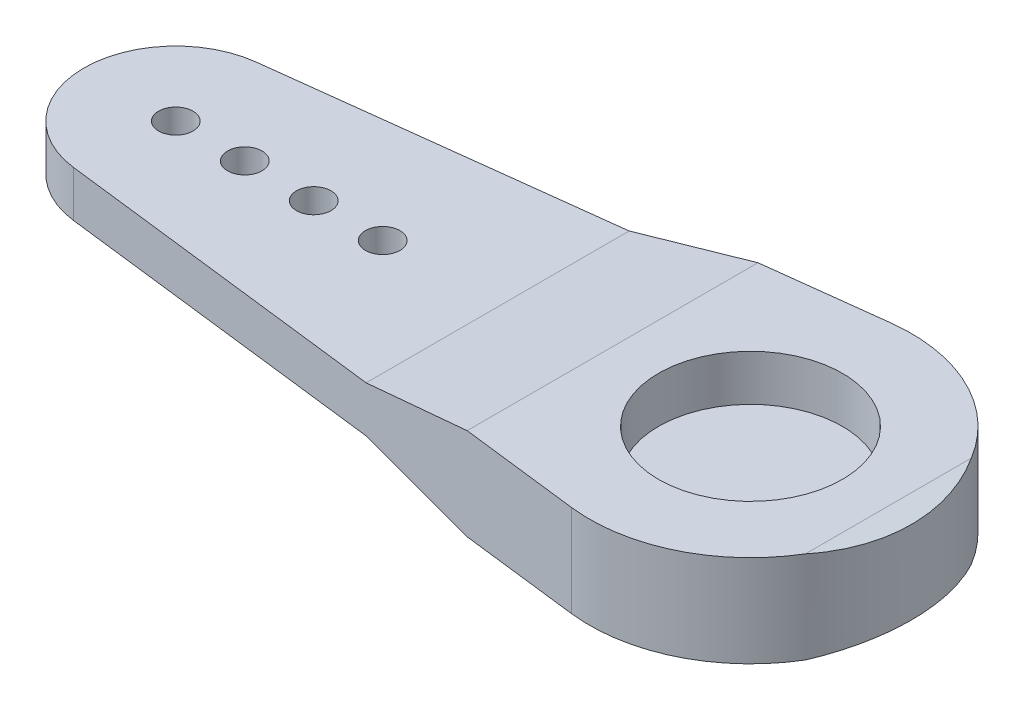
ISO-10303-21;
HEADER;
FILE_DESCRIPTION(('STEP AP214'),'2;1');
FILE_NAME('part.step','',(''),(''),'','','');
FILE_SCHEMA(('AUTOMOTIVE_DESIGN { 1 0 10303 214 1 1 1 1 }'));
ENDSEC;
DATA;
#1=APPLICATION_CONTEXT('core data for automotive mechanical design processes');
#2=APPLICATION_PROTOCOL_DEFINITION('international standard','automotive_design',2000,#1);
#3=PRODUCT_CONTEXT('',#1,'mechanical');
#4=PRODUCT('Part','Part','',(#3));
#5=PRODUCT_RELATED_PRODUCT_CATEGORY('part','',(#4));
#6=PRODUCT_DEFINITION_FORMATION('','',#4);
#7=PRODUCT_DEFINITION_CONTEXT('part definition',#1,'design');
#8=PRODUCT_DEFINITION('design','',#6,#7);
#9=PRODUCT_DEFINITION_SHAPE('','',#8);
#10=(LENGTH_UNIT() NAMED_UNIT(*) SI_UNIT(.MILLI.,.METRE.));
#11=(NAMED_UNIT(*) PLANE_ANGLE_UNIT() SI_UNIT($,.RADIAN.));
#12=(NAMED_UNIT(*) SI_UNIT($,.STERADIAN.) SOLID_ANGLE_UNIT());
#13=UNCERTAINTY_MEASURE_WITH_UNIT(LENGTH_MEASURE(1.E-05),#10,'distance_accuracy_value','');
#14=(GEOMETRIC_REPRESENTATION_CONTEXT(3) GLOBAL_UNCERTAINTY_ASSIGNED_CONTEXT((#13)) GLOBAL_UNIT_ASSIGNED_CONTEXT((#10,
#11,#12)) REPRESENTATION_CONTEXT('',''));
#15=CARTESIAN_POINT('',(0.,0.,0.));
#16=DIRECTION('',(0.,0.,1.));
#17=DIRECTION('',(1.,0.,0.));
#18=AXIS2_PLACEMENT_3D('',#15,#16,#17);
#19=CARTESIAN_POINT('',(-6.,0.,30.));
#20=DIRECTION('',(0.,1.,0.));
#21=DIRECTION('',(0.,0.,1.));
#22=AXIS2_PLACEMENT_3D('',#19,#20,#21);
#23=PLANE('',#22);
#24=DIRECTION('',(-0.992773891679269,0.,0.12));
#25=VECTOR('',#24,1.);
#26=CARTESIAN_POINT('',(-25.48,0.,11.0289044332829));
#27=LINE('',#26,#25);
#28=CARTESIAN_POINT('',(-0.839999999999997,0.,8.05058275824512));
#29=VERTEX_POINT('',#28);
#30=CARTESIAN_POINT('',(-5.99999999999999,0.,8.67428973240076));
#31=VERTEX_POINT('',#30);
#32=EDGE_CURVE('E125',#29,#31,#27,.T.);
#33=ORIENTED_EDGE('',*,*,#32,.F.);
#34=CARTESIAN_POINT('',(0.,0.,15.));
#35=DIRECTION('',(0.,1.,0.));
#36=DIRECTION('',(0.,0.,1.));
#37=AXIS2_PLACEMENT_3D('',#34,#35,#36);
#38=CIRCLE('',#37,7.);
#39=CARTESIAN_POINT('',(6.,0.,11.394448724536));
#40=VERTEX_POINT('',#39);
#41=EDGE_CURVE('E111',#40,#29,#38,.T.);
#42=ORIENTED_EDGE('',*,*,#41,.F.);
#43=DIRECTION('',(0.,0.,-1.));
#44=VECTOR('',#43,1.);
#45=CARTESIAN_POINT('',(6.,0.,30.));
#46=LINE('',#45,#44);
#47=CARTESIAN_POINT('',(6.,0.,18.605551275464));
#48=VERTEX_POINT('',#47);
#49=EDGE_CURVE('E181',#48,#40,#46,.T.);
#50=ORIENTED_EDGE('',*,*,#49,.F.);
#51=CARTESIAN_POINT('',(-0.840000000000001,0.,21.9494172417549));
#52=VERTEX_POINT('',#51);
#53=EDGE_CURVE('E51',#52,#48,#38,.T.);
#54=ORIENTED_EDGE('',*,*,#53,.F.);
#55=DIRECTION('',(0.992773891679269,0.,0.12));
#56=VECTOR('',#55,1.);
#57=CARTESIAN_POINT('',(-0.839999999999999,0.,21.9494172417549));
#58=LINE('',#57,#56);
#59=CARTESIAN_POINT('',(-6.,0.,21.3257102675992));
#60=VERTEX_POINT('',#59);
#61=EDGE_CURVE('E121',#60,#52,#58,.T.);
#62=ORIENTED_EDGE('',*,*,#61,.F.);
#63=DIRECTION('',(0.,0.,-1.));
#64=VECTOR('',#63,1.);
#65=CARTESIAN_POINT('',(-6.,0.,30.));
#66=LINE('',#65,#64);
#67=EDGE_CURVE('E137',#60,#31,#66,.T.);
#68=ORIENTED_EDGE('',*,*,#67,.T.);
#69=EDGE_LOOP('',(#33,#42,#50,#54,#62,#68));
#70=FACE_BOUND('',#69,.T.);
#71=CARTESIAN_POINT('',(0.,0.,15.));
#72=DIRECTION('',(0.,1.,0.));
#73=DIRECTION('',(0.,0.,1.));
#74=AXIS2_PLACEMENT_3D('',#71,#72,#73);
#75=CIRCLE('',#74,5.);
#76=CARTESIAN_POINT('',(0.,0.,20.));
#77=VERTEX_POINT('',#76);
#78=EDGE_CURVE('E11',#77,#77,#75,.F.);
#79=ORIENTED_EDGE('',*,*,#78,.F.);
#80=EDGE_LOOP('',(#79));
#81=FACE_BOUND('',#80,.T.);
#82=ADVANCED_FACE('F34',(#70,#81),#23,.F.);
#83=CARTESIAN_POINT('',(-6.,4.,30.));
#84=DIRECTION('',(0.,-1.,0.));
#85=DIRECTION('',(0.,0.,-1.));
#86=AXIS2_PLACEMENT_3D('',#83,#84,#85);
#87=PLANE('',#86);
#88=CARTESIAN_POINT('',(0.,4.,15.));
#89=DIRECTION('',(0.,1.,0.));
#90=DIRECTION('',(0.,0.,1.));
#91=AXIS2_PLACEMENT_3D('',#88,#89,#90);
#92=CIRCLE('',#91,4.);
#93=CARTESIAN_POINT('',(0.,4.,19.));
#94=VERTEX_POINT('',#93);
#95=EDGE_CURVE('E222',#94,#94,#92,.T.);
#96=ORIENTED_EDGE('',*,*,#95,.F.);
#97=EDGE_LOOP('',(#96));
#98=FACE_BOUND('',#97,.T.);
#99=DIRECTION('',(-0.992773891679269,0.,0.12));
#100=VECTOR('',#99,1.);
#101=CARTESIAN_POINT('',(-25.48,4.,11.0289044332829));
#102=LINE('',#101,#100);
#103=CARTESIAN_POINT('',(-0.839999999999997,4.,8.05058275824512));
#104=VERTEX_POINT('',#103);
#105=CARTESIAN_POINT('',(-5.99999999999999,4.,8.67428973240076));
#106=VERTEX_POINT('',#105);
#107=EDGE_CURVE('E128',#104,#106,#102,.T.);
#108=ORIENTED_EDGE('',*,*,#107,.T.);
#109=DIRECTION('',(0.,0.,-1.));
#110=VECTOR('',#109,1.);
#111=CARTESIAN_POINT('',(-6.,4.,30.));
#112=LINE('',#111,#110);
#113=CARTESIAN_POINT('',(-6.,4.,21.3257102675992));
#114=VERTEX_POINT('',#113);
#115=EDGE_CURVE('E175',#114,#106,#112,.T.);
#116=ORIENTED_EDGE('',*,*,#115,.F.);
#117=DIRECTION('',(0.992773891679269,0.,0.12));
#118=VECTOR('',#117,1.);
#119=CARTESIAN_POINT('',(-0.839999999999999,4.,21.9494172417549));
#120=LINE('',#119,#118);
#121=CARTESIAN_POINT('',(-0.839999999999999,4.,21.9494172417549));
#122=VERTEX_POINT('',#121);
#123=EDGE_CURVE('E144',#114,#122,#120,.T.);
#124=ORIENTED_EDGE('',*,*,#123,.T.);
#125=CARTESIAN_POINT('',(0.,4.,15.));
#126=DIRECTION('',(0.,1.,0.));
#127=DIRECTION('',(0.,0.,1.));
#128=AXIS2_PLACEMENT_3D('',#125,#126,#127);
#129=CIRCLE('',#128,7.);
#130=CARTESIAN_POINT('',(6.,4.,18.605551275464));
#131=VERTEX_POINT('',#130);
#132=EDGE_CURVE('E57',#122,#131,#129,.T.);
#133=ORIENTED_EDGE('',*,*,#132,.T.);
#134=DIRECTION('',(0.,0.,-1.));
#135=VECTOR('',#134,1.);
#136=CARTESIAN_POINT('',(6.,4.,30.));
#137=LINE('',#136,#135);
#138=CARTESIAN_POINT('',(6.,4.,11.394448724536));
#139=VERTEX_POINT('',#138);
#140=EDGE_CURVE('E178',#131,#139,#137,.T.);
#141=ORIENTED_EDGE('',*,*,#140,.T.);
#142=EDGE_CURVE('E147',#139,#104,#129,.T.);
#143=ORIENTED_EDGE('',*,*,#142,.T.);
#144=EDGE_LOOP('',(#108,#116,#124,#133,#141,#143));
#145=FACE_BOUND('',#144,.T.);
#146=ADVANCED_FACE('F248',(#98,#145),#87,.F.);
#147=CARTESIAN_POINT('',(6.,4.,30.));
#148=DIRECTION('',(-0.196116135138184,-0.98058067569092,0.));
#149=DIRECTION('',(0.98058067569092,-0.196116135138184,0.));
#150=AXIS2_PLACEMENT_3D('',#147,#148,#149);
#151=PLANE('',#150);
#152=CARTESIAN_POINT('',(0.,5.2,15.));
#153=DIRECTION('',(-0.196116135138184,-0.98058067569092,0.));
#154=DIRECTION('',(-0.98058067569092,0.196116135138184,0.));
#155=AXIS2_PLACEMENT_3D('',#152,#153,#154);
#156=ELLIPSE('',#155,7.1386273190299,7.);
#157=EDGE_CURVE('E162',#139,#131,#156,.T.);
#158=ORIENTED_EDGE('',*,*,#157,.F.);
#159=ORIENTED_EDGE('',*,*,#140,.F.);
#160=EDGE_LOOP('',(#158,#159));
#161=FACE_BOUND('',#160,.T.);
#162=ADVANCED_FACE('F252',(#161),#151,.F.);
#163=CARTESIAN_POINT('',(-30.,3.,30.));
#164=DIRECTION('',(0.,-1.,0.));
#165=DIRECTION('',(0.,0.,-1.));
#166=AXIS2_PLACEMENT_3D('',#163,#164,#165);
#167=PLANE('',#166);
#168=CARTESIAN_POINT('',(-25.,3.,15.));
#169=DIRECTION('',(0.,1.,0.));
#170=DIRECTION('',(0.,0.,1.));
#171=AXIS2_PLACEMENT_3D('',#168,#169,#170);
#172=CIRCLE('',#171,0.750000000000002);
#173=CARTESIAN_POINT('',(-25.,3.,15.75));
#174=VERTEX_POINT('',#173);
#175=EDGE_CURVE('E211',#174,#174,#172,.T.);
#176=ORIENTED_EDGE('',*,*,#175,.F.);
#177=EDGE_LOOP('',(#176));
#178=FACE_BOUND('',#177,.T.);
#179=CARTESIAN_POINT('',(-22.,3.,15.));
#180=DIRECTION('',(0.,1.,0.));
#181=DIRECTION('',(0.,0.,1.));
#182=AXIS2_PLACEMENT_3D('',#179,#180,#181);
#183=CIRCLE('',#182,0.750000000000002);
#184=CARTESIAN_POINT('',(-22.,3.,15.75));
#185=VERTEX_POINT('',#184);
#186=EDGE_CURVE('E201',#185,#185,#183,.T.);
#187=ORIENTED_EDGE('',*,*,#186,.F.);
#188=EDGE_LOOP('',(#187));
#189=FACE_BOUND('',#188,.T.);
#190=CARTESIAN_POINT('',(-19.,3.,15.));
#191=DIRECTION('',(0.,1.,0.));
#192=DIRECTION('',(0.,0.,1.));
#193=AXIS2_PLACEMENT_3D('',#190,#191,#192);
#194=CIRCLE('',#193,0.750000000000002);
#195=CARTESIAN_POINT('',(-19.,3.,15.75));
#196=VERTEX_POINT('',#195);
#197=EDGE_CURVE('E198',#196,#196,#194,.T.);
#198=ORIENTED_EDGE('',*,*,#197,.F.);
#199=EDGE_LOOP('',(#198));
#200=FACE_BOUND('',#199,.T.);
#201=CARTESIAN_POINT('',(-16.,3.,15.));
#202=DIRECTION('',(0.,1.,0.));
#203=DIRECTION('',(0.,0.,1.));
#204=AXIS2_PLACEMENT_3D('',#201,#202,#203);
#205=CIRCLE('',#204,0.75);
#206=CARTESIAN_POINT('',(-16.,3.,15.75));
#207=VERTEX_POINT('',#206);
#208=EDGE_CURVE('E195',#207,#207,#205,.T.);
#209=ORIENTED_EDGE('',*,*,#208,.F.);
#210=EDGE_LOOP('',(#209));
#211=FACE_BOUND('',#210,.T.);
#212=DIRECTION('',(0.992773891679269,0.,-0.12));
#213=VECTOR('',#212,1.);
#214=CARTESIAN_POINT('',(-32.1949930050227,3.,11.8405687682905));
#215=LINE('',#214,#213);
#216=CARTESIAN_POINT('',(-25.48,3.,11.0289044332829));
#217=VERTEX_POINT('',#216);
#218=CARTESIAN_POINT('',(-11.,3.,9.27865695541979));
#219=VERTEX_POINT('',#218);
#220=EDGE_CURVE('E169',#217,#219,#215,.T.);
#221=ORIENTED_EDGE('',*,*,#220,.F.);
#222=CARTESIAN_POINT('',(-25.,3.,15.));
#223=DIRECTION('',(0.,-1.,0.));
#224=DIRECTION('',(0.,0.,-1.));
#225=AXIS2_PLACEMENT_3D('',#222,#223,#224);
#226=CIRCLE('',#225,4.);
#227=CARTESIAN_POINT('',(-25.48,3.,18.9710955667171));
#228=VERTEX_POINT('',#227);
#229=EDGE_CURVE('E173',#228,#217,#226,.T.);
#230=ORIENTED_EDGE('',*,*,#229,.F.);
#231=DIRECTION('',(-0.992773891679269,0.,-0.12));
#232=VECTOR('',#231,1.);
#233=CARTESIAN_POINT('',(-28.6210069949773,3.,18.5914312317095));
#234=LINE('',#233,#232);
#235=CARTESIAN_POINT('',(-11.,3.,20.7213430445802));
#236=VERTEX_POINT('',#235);
#237=EDGE_CURVE('E158',#236,#228,#234,.T.);
#238=ORIENTED_EDGE('',*,*,#237,.F.);
#239=DIRECTION('',(0.,0.,-1.));
#240=VECTOR('',#239,1.);
#241=CARTESIAN_POINT('',(-11.,3.,30.));
#242=LINE('',#241,#240);
#243=EDGE_CURVE('E187',#236,#219,#242,.T.);
#244=ORIENTED_EDGE('',*,*,#243,.T.);
#245=EDGE_LOOP('',(#221,#230,#238,#244));
#246=FACE_BOUND('',#245,.T.);
#247=ADVANCED_FACE('F258',(#178,#189,#200,#211,#246),#167,.F.);
#248=CARTESIAN_POINT('',(-11.,3.,30.));
#249=DIRECTION('',(0.196116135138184,-0.98058067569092,0.));
#250=DIRECTION('',(0.98058067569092,0.196116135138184,0.));
#251=AXIS2_PLACEMENT_3D('',#248,#249,#250);
#252=PLANE('',#251);
#253=DIRECTION('',(0.973764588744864,0.194752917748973,-0.117702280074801));
#254=VECTOR('',#253,1.);
#255=CARTESIAN_POINT('',(-13.3749624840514,2.52500750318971,9.56572685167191));
#256=LINE('',#255,#254);
#257=EDGE_CURVE('E171',#219,#106,#256,.T.);
#258=ORIENTED_EDGE('',*,*,#257,.F.);
#259=ORIENTED_EDGE('',*,*,#243,.F.);
#260=DIRECTION('',(-0.973764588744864,-0.194752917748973,-0.117702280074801));
#261=VECTOR('',#260,1.);
#262=CARTESIAN_POINT('',(-9.93653311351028,3.21269337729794,20.8498879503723));
#263=LINE('',#262,#261);
#264=EDGE_CURVE('E160',#114,#236,#263,.T.);
#265=ORIENTED_EDGE('',*,*,#264,.F.);
#266=ORIENTED_EDGE('',*,*,#115,.T.);
#267=EDGE_LOOP('',(#258,#259,#265,#266));
#268=FACE_BOUND('',#267,.T.);
#269=ADVANCED_FACE('F36',(#268),#252,.F.);
#270=CARTESIAN_POINT('',(-25.,0.,15.));
#271=DIRECTION('',(0.,1.,0.));
#272=DIRECTION('',(0.,0.,1.));
#273=AXIS2_PLACEMENT_3D('',#270,#271,#272);
#274=CYLINDRICAL_SURFACE('',#273,4.);
#275=ORIENTED_EDGE('',*,*,#229,.T.);
#276=DIRECTION('',(0.,1.,0.));
#277=VECTOR('',#276,1.);
#278=CARTESIAN_POINT('',(-25.48,0.,11.0289044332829));
#279=LINE('',#278,#277);
#280=CARTESIAN_POINT('',(-25.48,1.,11.0289044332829));
#281=VERTEX_POINT('',#280);
#282=EDGE_CURVE('E130',#281,#217,#279,.T.);
#283=ORIENTED_EDGE('',*,*,#282,.F.);
#284=CARTESIAN_POINT('',(-25.,1.,15.));
#285=DIRECTION('',(0.,1.,0.));
#286=DIRECTION('',(0.,0.,1.));
#287=AXIS2_PLACEMENT_3D('',#284,#285,#286);
#288=CIRCLE('',#287,4.);
#289=CARTESIAN_POINT('',(-25.48,1.,18.9710955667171));
#290=VERTEX_POINT('',#289);
#291=EDGE_CURVE('E43',#281,#290,#288,.T.);
#292=ORIENTED_EDGE('',*,*,#291,.T.);
#293=DIRECTION('',(0.,1.,0.));
#294=VECTOR('',#293,1.);
#295=CARTESIAN_POINT('',(-25.48,0.,18.9710955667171));
#296=LINE('',#295,#294);
#297=EDGE_CURVE('E138',#290,#228,#296,.T.);
#298=ORIENTED_EDGE('',*,*,#297,.T.);
#299=EDGE_LOOP('',(#275,#283,#292,#298));
#300=FACE_BOUND('',#299,.T.);
#301=ADVANCED_FACE('F265',(#300),#274,.T.);
#302=CARTESIAN_POINT('',(-25.48,0.,11.0289044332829));
#303=DIRECTION('',(-0.12,0.,-0.992773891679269));
#304=DIRECTION('',(-0.992773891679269,0.,0.12));
#305=AXIS2_PLACEMENT_3D('',#302,#303,#304);
#306=PLANE('',#305);
#307=ORIENTED_EDGE('',*,*,#257,.T.);
#308=ORIENTED_EDGE('',*,*,#107,.F.);
#309=DIRECTION('',(0.,1.,0.));
#310=VECTOR('',#309,1.);
#311=CARTESIAN_POINT('',(-0.839999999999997,0.,8.05058275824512));
#312=LINE('',#311,#310);
#313=EDGE_CURVE('E114',#29,#104,#312,.T.);
#314=ORIENTED_EDGE('',*,*,#313,.F.);
#315=ORIENTED_EDGE('',*,*,#32,.T.);
#316=DIRECTION('',(-0.973764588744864,0.194752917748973,0.117702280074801));
#317=VECTOR('',#316,1.);
#318=CARTESIAN_POINT('',(-8.44423161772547,0.488846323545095,8.96973242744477));
#319=LINE('',#318,#317);
#320=CARTESIAN_POINT('',(-11.,1.,9.27865695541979));
#321=VERTEX_POINT('',#320);
#322=EDGE_CURVE('E165',#31,#321,#319,.T.);
#323=ORIENTED_EDGE('',*,*,#322,.T.);
#324=DIRECTION('',(-0.992773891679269,0.,0.12));
#325=VECTOR('',#324,1.);
#326=CARTESIAN_POINT('',(-32.1949930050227,1.,11.8405687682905));
#327=LINE('',#326,#325);
#328=EDGE_CURVE('E167',#321,#281,#327,.T.);
#329=ORIENTED_EDGE('',*,*,#328,.T.);
#330=ORIENTED_EDGE('',*,*,#282,.T.);
#331=ORIENTED_EDGE('',*,*,#220,.T.);
#332=EDGE_LOOP('',(#307,#308,#314,#315,#323,#329,#330,#331));
#333=FACE_BOUND('',#332,.T.);
#334=ADVANCED_FACE('F124',(#333),#306,.T.);
#335=CARTESIAN_POINT('',(0.,0.,15.));
#336=DIRECTION('',(0.,1.,0.));
#337=DIRECTION('',(0.,0.,1.));
#338=AXIS2_PLACEMENT_3D('',#335,#336,#337);
#339=CYLINDRICAL_SURFACE('',#338,7.);
#340=CARTESIAN_POINT('',(0.,-1.20000000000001,15.));
#341=DIRECTION('',(-0.196116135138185,0.98058067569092,0.));
#342=DIRECTION('',(0.98058067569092,0.196116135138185,0.));
#343=AXIS2_PLACEMENT_3D('',#340,#341,#342);
#344=ELLIPSE('',#343,7.1386273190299,7.);
#345=EDGE_CURVE('E116',#48,#40,#344,.T.);
#346=ORIENTED_EDGE('',*,*,#345,.T.);
#347=ORIENTED_EDGE('',*,*,#41,.T.);
#348=ORIENTED_EDGE('',*,*,#313,.T.);
#349=ORIENTED_EDGE('',*,*,#142,.F.);
#350=ORIENTED_EDGE('',*,*,#157,.T.);
#351=ORIENTED_EDGE('',*,*,#132,.F.);
#352=DIRECTION('',(0.,1.,0.));
#353=VECTOR('',#352,1.);
#354=CARTESIAN_POINT('',(-0.839999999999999,0.,21.9494172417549));
#355=LINE('',#354,#353);
#356=EDGE_CURVE('E131',#52,#122,#355,.T.);
#357=ORIENTED_EDGE('',*,*,#356,.F.);
#358=ORIENTED_EDGE('',*,*,#53,.T.);
#359=EDGE_LOOP('',(#346,#347,#348,#349,#350,#351,#357,#358));
#360=FACE_BOUND('',#359,.T.);
#361=ADVANCED_FACE('F113',(#360),#339,.T.);
#362=CARTESIAN_POINT('',(-0.839999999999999,0.,21.9494172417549));
#363=DIRECTION('',(-0.12,0.,0.992773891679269));
#364=DIRECTION('',(0.992773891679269,0.,0.12));
#365=AXIS2_PLACEMENT_3D('',#362,#363,#364);
#366=PLANE('',#365);
#367=ORIENTED_EDGE('',*,*,#264,.T.);
#368=ORIENTED_EDGE('',*,*,#237,.T.);
#369=ORIENTED_EDGE('',*,*,#297,.F.);
#370=DIRECTION('',(0.992773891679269,0.,0.12));
#371=VECTOR('',#370,1.);
#372=CARTESIAN_POINT('',(-28.6210069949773,1.,18.5914312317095));
#373=LINE('',#372,#371);
#374=CARTESIAN_POINT('',(-11.,1.,20.7213430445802));
#375=VERTEX_POINT('',#374);
#376=EDGE_CURVE('E156',#290,#375,#373,.T.);
#377=ORIENTED_EDGE('',*,*,#376,.T.);
#378=DIRECTION('',(0.973764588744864,-0.194752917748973,0.117702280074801));
#379=VECTOR('',#378,1.);
#380=CARTESIAN_POINT('',(-5.00580224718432,-0.198839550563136,21.4458823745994));
#381=LINE('',#380,#379);
#382=EDGE_CURVE('E152',#375,#60,#381,.T.);
#383=ORIENTED_EDGE('',*,*,#382,.T.);
#384=ORIENTED_EDGE('',*,*,#61,.T.);
#385=ORIENTED_EDGE('',*,*,#356,.T.);
#386=ORIENTED_EDGE('',*,*,#123,.F.);
#387=EDGE_LOOP('',(#367,#368,#369,#377,#383,#384,#385,#386));
#388=FACE_BOUND('',#387,.T.);
#389=ADVANCED_FACE('F227',(#388),#366,.T.);
#390=CARTESIAN_POINT('',(-30.,1.,30.));
#391=DIRECTION('',(0.,1.,0.));
#392=DIRECTION('',(0.,0.,1.));
#393=AXIS2_PLACEMENT_3D('',#390,#391,#392);
#394=PLANE('',#393);
#395=CARTESIAN_POINT('',(-25.,1.,15.));
#396=DIRECTION('',(0.,1.,0.));
#397=DIRECTION('',(0.,0.,1.));
#398=AXIS2_PLACEMENT_3D('',#395,#396,#397);
#399=CIRCLE('',#398,0.750000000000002);
#400=CARTESIAN_POINT('',(-25.,1.,15.75));
#401=VERTEX_POINT('',#400);
#402=EDGE_CURVE('E38',#401,#401,#399,.T.);
#403=ORIENTED_EDGE('',*,*,#402,.T.);
#404=EDGE_LOOP('',(#403));
#405=FACE_BOUND('',#404,.T.);
#406=CARTESIAN_POINT('',(-22.,1.,15.));
#407=DIRECTION('',(0.,1.,0.));
#408=DIRECTION('',(0.,0.,1.));
#409=AXIS2_PLACEMENT_3D('',#406,#407,#408);
#410=CIRCLE('',#409,0.750000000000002);
#411=CARTESIAN_POINT('',(-22.,1.,15.75));
#412=VERTEX_POINT('',#411);
#413=EDGE_CURVE('E199',#412,#412,#410,.T.);
#414=ORIENTED_EDGE('',*,*,#413,.T.);
#415=EDGE_LOOP('',(#414));
#416=FACE_BOUND('',#415,.T.);
#417=CARTESIAN_POINT('',(-19.,1.,15.));
#418=DIRECTION('',(0.,1.,0.));
#419=DIRECTION('',(0.,0.,1.));
#420=AXIS2_PLACEMENT_3D('',#417,#418,#419);
#421=CIRCLE('',#420,0.750000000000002);
#422=CARTESIAN_POINT('',(-19.,1.,15.75));
#423=VERTEX_POINT('',#422);
#424=EDGE_CURVE('E196',#423,#423,#421,.T.);
#425=ORIENTED_EDGE('',*,*,#424,.T.);
#426=EDGE_LOOP('',(#425));
#427=FACE_BOUND('',#426,.T.);
#428=CARTESIAN_POINT('',(-16.,1.,15.));
#429=DIRECTION('',(0.,1.,0.));
#430=DIRECTION('',(0.,0.,1.));
#431=AXIS2_PLACEMENT_3D('',#428,#429,#430);
#432=CIRCLE('',#431,0.75);
#433=CARTESIAN_POINT('',(-16.,1.,15.75));
#434=VERTEX_POINT('',#433);
#435=EDGE_CURVE('E191',#434,#434,#432,.T.);
#436=ORIENTED_EDGE('',*,*,#435,.T.);
#437=EDGE_LOOP('',(#436));
#438=FACE_BOUND('',#437,.T.);
#439=ORIENTED_EDGE('',*,*,#328,.F.);
#440=DIRECTION('',(0.,0.,-1.));
#441=VECTOR('',#440,1.);
#442=CARTESIAN_POINT('',(-11.,1.,30.));
#443=LINE('',#442,#441);
#444=EDGE_CURVE('E184',#375,#321,#443,.T.);
#445=ORIENTED_EDGE('',*,*,#444,.F.);
#446=ORIENTED_EDGE('',*,*,#376,.F.);
#447=ORIENTED_EDGE('',*,*,#291,.F.);
#448=EDGE_LOOP('',(#439,#445,#446,#447));
#449=FACE_BOUND('',#448,.T.);
#450=ADVANCED_FACE('F242',(#405,#416,#427,#438,#449),#394,.F.);
#451=CARTESIAN_POINT('',(-6.,0.,30.));
#452=DIRECTION('',(0.196116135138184,0.98058067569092,0.));
#453=DIRECTION('',(-0.98058067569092,0.196116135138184,0.));
#454=AXIS2_PLACEMENT_3D('',#451,#452,#453);
#455=PLANE('',#454);
#456=ORIENTED_EDGE('',*,*,#322,.F.);
#457=ORIENTED_EDGE('',*,*,#67,.F.);
#458=ORIENTED_EDGE('',*,*,#382,.F.);
#459=ORIENTED_EDGE('',*,*,#444,.T.);
#460=EDGE_LOOP('',(#456,#457,#458,#459));
#461=FACE_BOUND('',#460,.T.);
#462=ADVANCED_FACE('F233',(#461),#455,.F.);
#463=CARTESIAN_POINT('',(11.,1.,30.));
#464=DIRECTION('',(-0.196116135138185,0.98058067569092,0.));
#465=DIRECTION('',(-0.98058067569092,-0.196116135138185,0.));
#466=AXIS2_PLACEMENT_3D('',#463,#464,#465);
#467=PLANE('',#466);
#468=ORIENTED_EDGE('',*,*,#345,.F.);
#469=ORIENTED_EDGE('',*,*,#49,.T.);
#470=EDGE_LOOP('',(#468,#469));
#471=FACE_BOUND('',#470,.T.);
#472=ADVANCED_FACE('F230',(#471),#467,.F.);
#473=CARTESIAN_POINT('',(0.,2.,15.));
#474=DIRECTION('',(0.,1.,0.));
#475=DIRECTION('',(0.,0.,1.));
#476=AXIS2_PLACEMENT_3D('',#473,#474,#475);
#477=CYLINDRICAL_SURFACE('',#476,4.);
#478=CARTESIAN_POINT('',(0.,2.,15.));
#479=DIRECTION('',(0.,1.,0.));
#480=DIRECTION('',(0.,0.,1.));
#481=AXIS2_PLACEMENT_3D('',#478,#479,#480);
#482=CIRCLE('',#481,4.);
#483=CARTESIAN_POINT('',(0.,2.,19.));
#484=VERTEX_POINT('',#483);
#485=EDGE_CURVE('E148',#484,#484,#482,.T.);
#486=ORIENTED_EDGE('',*,*,#485,.F.);
#487=EDGE_LOOP('',(#486));
#488=FACE_BOUND('',#487,.T.);
#489=ORIENTED_EDGE('',*,*,#95,.T.);
#490=EDGE_LOOP('',(#489));
#491=FACE_BOUND('',#490,.T.);
#492=ADVANCED_FACE('F232',(#488,#491),#477,.F.);
#493=CARTESIAN_POINT('',(0.,2.,15.));
#494=DIRECTION('',(0.,1.,0.));
#495=DIRECTION('',(0.,0.,1.));
#496=AXIS2_PLACEMENT_3D('',#493,#494,#495);
#497=PLANE('',#496);
#498=ORIENTED_EDGE('',*,*,#485,.T.);
#499=EDGE_LOOP('',(#498));
#500=FACE_BOUND('',#499,.T.);
#501=ADVANCED_FACE('F239',(#500),#497,.T.);
#502=CARTESIAN_POINT('',(0.,-0.5,15.));
#503=DIRECTION('',(0.,1.,0.));
#504=DIRECTION('',(0.,0.,1.));
#505=AXIS2_PLACEMENT_3D('',#502,#503,#504);
#506=CYLINDRICAL_SURFACE('',#505,5.);
#507=CARTESIAN_POINT('',(0.,-0.5,15.));
#508=DIRECTION('',(0.,-1.,0.));
#509=DIRECTION('',(0.,0.,-1.));
#510=AXIS2_PLACEMENT_3D('',#507,#508,#509);
#511=CIRCLE('',#510,5.);
#512=CARTESIAN_POINT('',(0.,-0.5,10.));
#513=VERTEX_POINT('',#512);
#514=EDGE_CURVE('E219',#513,#513,#511,.T.);
#515=ORIENTED_EDGE('',*,*,#514,.F.);
#516=EDGE_LOOP('',(#515));
#517=FACE_BOUND('',#516,.T.);
#518=ORIENTED_EDGE('',*,*,#78,.T.);
#519=EDGE_LOOP('',(#518));
#520=FACE_BOUND('',#519,.T.);
#521=ADVANCED_FACE('F307',(#517,#520),#506,.T.);
#522=CARTESIAN_POINT('',(0.,-0.5,15.));
#523=DIRECTION('',(0.,1.,0.));
#524=DIRECTION('',(0.,0.,-1.));
#525=AXIS2_PLACEMENT_3D('',#522,#523,#524);
#526=CONICAL_SURFACE('',#525,5.,0.78539816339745);
#527=CARTESIAN_POINT('',(0.,-2.,15.));
#528=DIRECTION('',(0.,-1.,0.));
#529=DIRECTION('',(0.,0.,-1.));
#530=AXIS2_PLACEMENT_3D('',#527,#528,#529);
#531=CIRCLE('',#530,3.5);
#532=CARTESIAN_POINT('',(0.,-2.,11.5));
#533=VERTEX_POINT('',#532);
#534=EDGE_CURVE('E194',#533,#533,#531,.T.);
#535=ORIENTED_EDGE('',*,*,#534,.F.);
#536=EDGE_LOOP('',(#535));
#537=FACE_BOUND('',#536,.T.);
#538=ORIENTED_EDGE('',*,*,#514,.T.);
#539=EDGE_LOOP('',(#538));
#540=FACE_BOUND('',#539,.T.);
#541=ADVANCED_FACE('F311',(#537,#540),#526,.T.);
#542=CARTESIAN_POINT('',(0.,-2.,15.));
#543=DIRECTION('',(0.,-1.,0.));
#544=DIRECTION('',(0.,0.,-1.));
#545=AXIS2_PLACEMENT_3D('',#542,#543,#544);
#546=PLANE('',#545);
#547=CARTESIAN_POINT('',(0.,-2.,15.));
#548=DIRECTION('',(0.,-1.,0.));
#549=DIRECTION('',(0.,0.,-1.));
#550=AXIS2_PLACEMENT_3D('',#547,#548,#549);
#551=CIRCLE('',#550,2.9);
#552=CARTESIAN_POINT('',(0.,-2.,12.1));
#553=VERTEX_POINT('',#552);
#554=EDGE_CURVE('E347',#553,#553,#551,.T.);
#555=ORIENTED_EDGE('',*,*,#554,.F.);
#556=EDGE_LOOP('',(#555));
#557=FACE_BOUND('',#556,.T.);
#558=ORIENTED_EDGE('',*,*,#534,.T.);
#559=EDGE_LOOP('',(#558));
#560=FACE_BOUND('',#559,.T.);
#561=ADVANCED_FACE('F315',(#557,#560),#546,.T.);
#562=CARTESIAN_POINT('',(-16.,-2.,15.));
#563=DIRECTION('',(0.,1.,0.));
#564=DIRECTION('',(0.,0.,1.));
#565=AXIS2_PLACEMENT_3D('',#562,#563,#564);
#566=CYLINDRICAL_SURFACE('',#565,0.75);
#567=ORIENTED_EDGE('',*,*,#208,.T.);
#568=EDGE_LOOP('',(#567));
#569=FACE_BOUND('',#568,.T.);
#570=ORIENTED_EDGE('',*,*,#435,.F.);
#571=EDGE_LOOP('',(#570));
#572=FACE_BOUND('',#571,.T.);
#573=ADVANCED_FACE('F319',(#569,#572),#566,.F.);
#574=CARTESIAN_POINT('',(-19.,-2.,15.));
#575=DIRECTION('',(0.,1.,0.));
#576=DIRECTION('',(0.,0.,1.));
#577=AXIS2_PLACEMENT_3D('',#574,#575,#576);
#578=CYLINDRICAL_SURFACE('',#577,0.750000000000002);
#579=ORIENTED_EDGE('',*,*,#197,.T.);
#580=EDGE_LOOP('',(#579));
#581=FACE_BOUND('',#580,.T.);
#582=ORIENTED_EDGE('',*,*,#424,.F.);
#583=EDGE_LOOP('',(#582));
#584=FACE_BOUND('',#583,.T.);
#585=ADVANCED_FACE('F323',(#581,#584),#578,.F.);
#586=CARTESIAN_POINT('',(-22.,-2.,15.));
#587=DIRECTION('',(0.,1.,0.));
#588=DIRECTION('',(0.,0.,1.));
#589=AXIS2_PLACEMENT_3D('',#586,#587,#588);
#590=CYLINDRICAL_SURFACE('',#589,0.750000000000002);
#591=ORIENTED_EDGE('',*,*,#186,.T.);
#592=EDGE_LOOP('',(#591));
#593=FACE_BOUND('',#592,.T.);
#594=ORIENTED_EDGE('',*,*,#413,.F.);
#595=EDGE_LOOP('',(#594));
#596=FACE_BOUND('',#595,.T.);
#597=ADVANCED_FACE('F327',(#593,#596),#590,.F.);
#598=CARTESIAN_POINT('',(-25.,-2.,15.));
#599=DIRECTION('',(0.,1.,0.));
#600=DIRECTION('',(0.,0.,1.));
#601=AXIS2_PLACEMENT_3D('',#598,#599,#600);
#602=CYLINDRICAL_SURFACE('',#601,0.750000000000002);
#603=ORIENTED_EDGE('',*,*,#175,.T.);
#604=EDGE_LOOP('',(#603));
#605=FACE_BOUND('',#604,.T.);
#606=ORIENTED_EDGE('',*,*,#402,.F.);
#607=EDGE_LOOP('',(#606));
#608=FACE_BOUND('',#607,.T.);
#609=ADVANCED_FACE('F331',(#605,#608),#602,.F.);
#610=CARTESIAN_POINT('',(0.,0.7,15.));
#611=DIRECTION('',(0.,-1.,0.));
#612=DIRECTION('',(0.,0.,-1.));
#613=AXIS2_PLACEMENT_3D('',#610,#611,#612);
#614=CYLINDRICAL_SURFACE('',#613,2.9);
#615=CARTESIAN_POINT('',(0.,0.7,15.));
#616=DIRECTION('',(0.,-1.,0.));
#617=DIRECTION('',(0.,0.,-1.));
#618=AXIS2_PLACEMENT_3D('',#615,#616,#617);
#619=CIRCLE('',#618,2.9);
#620=CARTESIAN_POINT('',(0.,0.7,12.1));
#621=VERTEX_POINT('',#620);
#622=EDGE_CURVE('E346',#621,#621,#619,.T.);
#623=CARTESIAN_POINT('',(0.,0.7,12.1));
#624=CARTESIAN_POINT('',(0.,0.671875,12.1));
#625=CARTESIAN_POINT('',(0.,0.64375,12.1));
#626=CARTESIAN_POINT('',(0.,0.5875,12.1));
#627=CARTESIAN_POINT('',(0.,0.559375,12.1));
#628=CARTESIAN_POINT('',(0.,0.503125,12.1));
#629=CARTESIAN_POINT('',(0.,0.475,12.1));
#630=CARTESIAN_POINT('',(0.,0.41875,12.1));
#631=CARTESIAN_POINT('',(0.,0.390625,12.1));
#632=CARTESIAN_POINT('',(0.,0.334375,12.1));
#633=CARTESIAN_POINT('',(0.,0.30625,12.1));
#634=CARTESIAN_POINT('',(0.,0.25,12.1));
#635=CARTESIAN_POINT('',(0.,0.221875,12.1));
#636=CARTESIAN_POINT('',(0.,0.165625,12.1));
#637=CARTESIAN_POINT('',(0.,0.1375,12.1));
#638=CARTESIAN_POINT('',(0.,0.0812500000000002,12.1));
#639=CARTESIAN_POINT('',(0.,0.0531250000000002,12.1));
#640=CARTESIAN_POINT('',(0.,-0.00312499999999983,12.1));
#641=CARTESIAN_POINT('',(0.,-0.0312499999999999,12.1));
#642=CARTESIAN_POINT('',(0.,-0.0874999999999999,12.1));
#643=CARTESIAN_POINT('',(0.,-0.115625,12.1));
#644=CARTESIAN_POINT('',(0.,-0.171875,12.1));
#645=CARTESIAN_POINT('',(0.,-0.2,12.1));
#646=CARTESIAN_POINT('',(0.,-0.25625,12.1));
#647=CARTESIAN_POINT('',(0.,-0.284375,12.1));
#648=CARTESIAN_POINT('',(0.,-0.340625,12.1));
#649=CARTESIAN_POINT('',(0.,-0.36875,12.1));
#650=CARTESIAN_POINT('',(0.,-0.425,12.1));
#651=CARTESIAN_POINT('',(0.,-0.453125,12.1));
#652=CARTESIAN_POINT('',(0.,-0.509375,12.1));
#653=CARTESIAN_POINT('',(0.,-0.5375,12.1));
#654=CARTESIAN_POINT('',(0.,-0.59375,12.1));
#655=CARTESIAN_POINT('',(0.,-0.621875,12.1));
#656=CARTESIAN_POINT('',(0.,-0.678125,12.1));
#657=CARTESIAN_POINT('',(0.,-0.70625,12.1));
#658=CARTESIAN_POINT('',(0.,-0.7625,12.1));
#659=CARTESIAN_POINT('',(0.,-0.790625,12.1));
#660=CARTESIAN_POINT('',(0.,-0.846875,12.1));
#661=CARTESIAN_POINT('',(0.,-0.875,12.1));
#662=CARTESIAN_POINT('',(0.,-0.93125,12.1));
#663=CARTESIAN_POINT('',(0.,-0.959375,12.1));
#664=CARTESIAN_POINT('',(0.,-1.015625,12.1));
#665=CARTESIAN_POINT('',(0.,-1.04375,12.1));
#666=CARTESIAN_POINT('',(0.,-1.1,12.1));
#667=CARTESIAN_POINT('',(0.,-1.128125,12.1));
#668=CARTESIAN_POINT('',(0.,-1.184375,12.1));
#669=CARTESIAN_POINT('',(0.,-1.2125,12.1));
#670=CARTESIAN_POINT('',(0.,-1.26875,12.1));
#671=CARTESIAN_POINT('',(0.,-1.296875,12.1));
#672=CARTESIAN_POINT('',(0.,-1.353125,12.1));
#673=CARTESIAN_POINT('',(0.,-1.38125,12.1));
#674=CARTESIAN_POINT('',(0.,-1.4375,12.1));
#675=CARTESIAN_POINT('',(0.,-1.465625,12.1));
#676=CARTESIAN_POINT('',(0.,-1.521875,12.1));
#677=CARTESIAN_POINT('',(0.,-1.55,12.1));
#678=CARTESIAN_POINT('',(0.,-1.60625,12.1));
#679=CARTESIAN_POINT('',(0.,-1.634375,12.1));
#680=CARTESIAN_POINT('',(0.,-1.690625,12.1));
#681=CARTESIAN_POINT('',(0.,-1.71875,12.1));
#682=CARTESIAN_POINT('',(0.,-1.775,12.1));
#683=CARTESIAN_POINT('',(0.,-1.803125,12.1));
#684=CARTESIAN_POINT('',(0.,-1.859375,12.1));
#685=CARTESIAN_POINT('',(0.,-1.8875,12.1));
#686=CARTESIAN_POINT('',(0.,-1.94375,12.1));
#687=CARTESIAN_POINT('',(0.,-1.971875,12.1));
#688=CARTESIAN_POINT('',(0.,-2.,12.1));
#689=B_SPLINE_CURVE_WITH_KNOTS('',3,(#623,#624,#625,#626,#627,#628,#629,#630,#631,#632,#633,
#634,#635,#636,#637,#638,#639,#640,#641,#642,#643,#644,#645,#646,#647,#648,#649,#650,#651,#652,
#653,#654,#655,#656,#657,#658,#659,#660,#661,#662,#663,#664,#665,#666,#667,#668,#669,#670,#671,
#672,#673,#674,#675,#676,#677,#678,#679,#680,#681,#682,#683,#684,#685,#686,#687,#688),
.UNSPECIFIED.,.F.,.F.,(4,2,2,2,2,2,2,2,2,2,2,2,2,2,2,2,2,2,2,2,2,2,2,2,2,2,2,2,2,2,2,2,4),(0.,
0.0843749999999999,0.16875,0.253125,0.3375,0.421875,0.50625,0.590625,0.675,0.759375,0.84375,
0.928125,1.0125,1.096875,1.18125,1.265625,1.35,1.434375,1.51875,1.603125,1.6875,1.771875,
1.85625,1.940625,2.025,2.109375,2.19375,2.278125,2.3625,2.446875,2.53125,2.615625,2.7),.UNSPECIFIED.);
#690=EDGE_CURVE('BSEAM334',#621,#553,#689,.T.);
#691=ORIENTED_EDGE('',*,*,#622,.F.);
#692=ORIENTED_EDGE('',*,*,#554,.T.);
#693=ORIENTED_EDGE('',*,*,#690,.T.);
#694=ORIENTED_EDGE('',*,*,#690,.F.);
#695=EDGE_LOOP('',(#691,#693,#692,#694));
#696=FACE_BOUND('',#695,.T.);
#697=ADVANCED_FACE('F334',(#696),#614,.F.);
#698=CARTESIAN_POINT('',(0.,0.7,15.));
#699=DIRECTION('',(0.,-1.,0.));
#700=DIRECTION('',(0.,0.,-1.));
#701=AXIS2_PLACEMENT_3D('',#698,#699,#700);
#702=PLANE('',#701);
#703=ORIENTED_EDGE('',*,*,#622,.T.);
#704=EDGE_LOOP('',(#703));
#705=FACE_BOUND('',#704,.T.);
#706=ADVANCED_FACE('F338',(#705),#702,.T.);
#707=CLOSED_SHELL('',(#82,#146,#162,#247,#269,#301,#334,#361,#389,#450,#462,#472,#492,#501,#521,
#541,#561,#573,#585,#597,#609,#697,#706));
#708=MANIFOLD_SOLID_BREP('B2',#707);
#709=ADVANCED_BREP_SHAPE_REPRESENTATION('',(#18,#708),#14);
#710=SHAPE_DEFINITION_REPRESENTATION(#9,#709);
ENDSEC;
END-ISO-10303-21;
